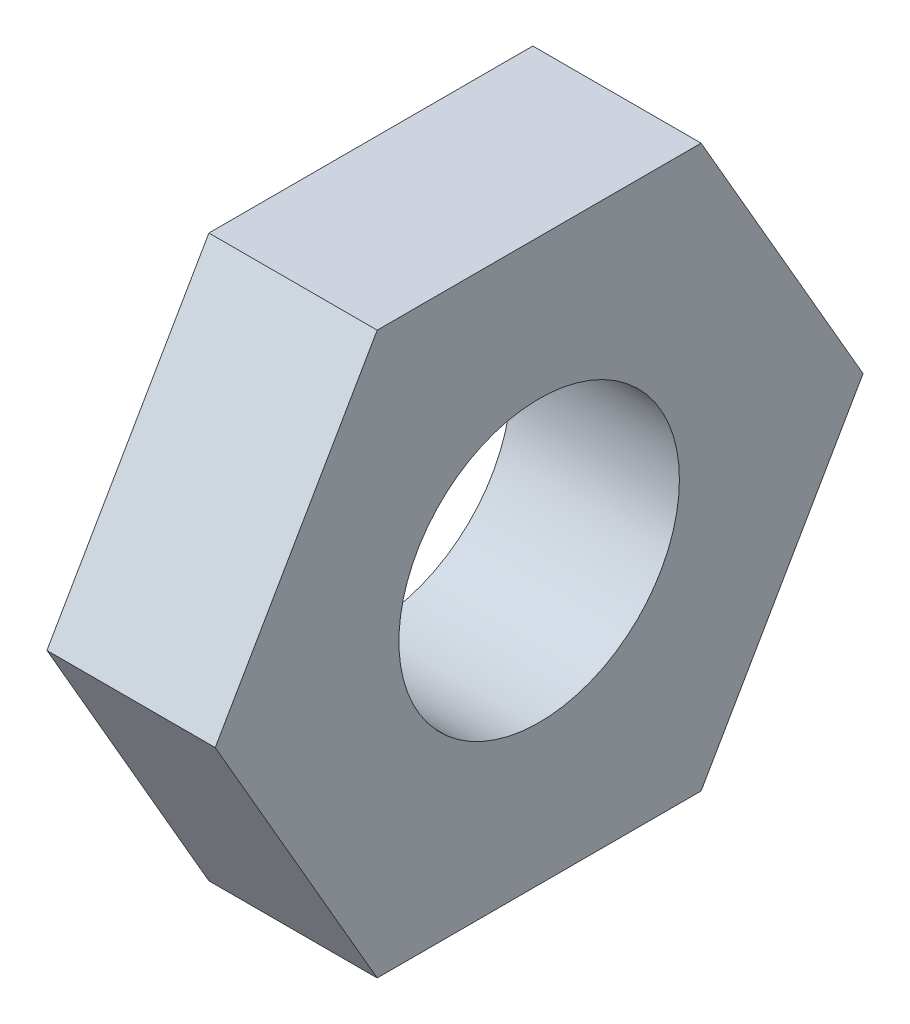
ISO-10303-21;
HEADER;
FILE_DESCRIPTION(('STEP AP214'),'2;1');
FILE_NAME('part.step','',(''),(''),'','','');
FILE_SCHEMA(('AUTOMOTIVE_DESIGN { 1 0 10303 214 1 1 1 1 }'));
ENDSEC;
DATA;
#1=APPLICATION_CONTEXT('core data for automotive mechanical design processes');
#2=APPLICATION_PROTOCOL_DEFINITION('international standard','automotive_design',2000,#1);
#3=PRODUCT_CONTEXT('',#1,'mechanical');
#4=PRODUCT('Part','Part','',(#3));
#5=PRODUCT_RELATED_PRODUCT_CATEGORY('part','',(#4));
#6=PRODUCT_DEFINITION_FORMATION('','',#4);
#7=PRODUCT_DEFINITION_CONTEXT('part definition',#1,'design');
#8=PRODUCT_DEFINITION('design','',#6,#7);
#9=PRODUCT_DEFINITION_SHAPE('','',#8);
#10=(LENGTH_UNIT() NAMED_UNIT(*) SI_UNIT(.MILLI.,.METRE.));
#11=(NAMED_UNIT(*) PLANE_ANGLE_UNIT() SI_UNIT($,.RADIAN.));
#12=(NAMED_UNIT(*) SI_UNIT($,.STERADIAN.) SOLID_ANGLE_UNIT());
#13=UNCERTAINTY_MEASURE_WITH_UNIT(LENGTH_MEASURE(1.E-05),#10,'distance_accuracy_value','');
#14=(GEOMETRIC_REPRESENTATION_CONTEXT(3) GLOBAL_UNCERTAINTY_ASSIGNED_CONTEXT((#13)) GLOBAL_UNIT_ASSIGNED_CONTEXT((#10,
#11,#12)) REPRESENTATION_CONTEXT('',''));
#15=CARTESIAN_POINT('',(0.,0.,0.));
#16=DIRECTION('',(0.,0.,1.));
#17=DIRECTION('',(1.,0.,0.));
#18=AXIS2_PLACEMENT_3D('',#15,#16,#17);
#19=CARTESIAN_POINT('',(3.,0.,0.));
#20=DIRECTION('',(1.,0.,0.));
#21=DIRECTION('',(0.,0.,-1.));
#22=AXIS2_PLACEMENT_3D('',#19,#20,#21);
#23=PLANE('',#22);
#24=DIRECTION('',(0.,0.866025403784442,-0.499999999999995));
#25=VECTOR('',#24,1.);
#26=CARTESIAN_POINT('',(3.,-4.99999999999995,-2.88675134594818));
#27=LINE('',#26,#25);
#28=CARTESIAN_POINT('',(3.,-4.99999999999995,-2.88675134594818));
#29=VERTEX_POINT('',#28);
#30=CARTESIAN_POINT('',(3.,0.,-5.77350269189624));
#31=VERTEX_POINT('',#30);
#32=EDGE_CURVE('E128',#29,#31,#27,.T.);
#33=ORIENTED_EDGE('',*,*,#32,.T.);
#34=DIRECTION('',(0.,0.866025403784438,0.500000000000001));
#35=VECTOR('',#34,1.);
#36=CARTESIAN_POINT('',(3.,0.,-5.77350269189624));
#37=LINE('',#36,#35);
#38=CARTESIAN_POINT('',(3.,4.99999999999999,-2.88675134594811));
#39=VERTEX_POINT('',#38);
#40=EDGE_CURVE('E86',#31,#39,#37,.T.);
#41=ORIENTED_EDGE('',*,*,#40,.T.);
#42=DIRECTION('',(0.,0.,1.));
#43=VECTOR('',#42,1.);
#44=CARTESIAN_POINT('',(3.,4.99999999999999,-2.88675134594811));
#45=LINE('',#44,#43);
#46=CARTESIAN_POINT('',(3.,4.99999999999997,2.88675134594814));
#47=VERTEX_POINT('',#46);
#48=EDGE_CURVE('E99',#39,#47,#45,.T.);
#49=ORIENTED_EDGE('',*,*,#48,.T.);
#50=DIRECTION('',(0.,-0.866025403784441,0.499999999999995));
#51=VECTOR('',#50,1.);
#52=CARTESIAN_POINT('',(3.,4.99999999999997,2.88675134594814));
#53=LINE('',#52,#51);
#54=CARTESIAN_POINT('',(3.,0.,5.77350269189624));
#55=VERTEX_POINT('',#54);
#56=EDGE_CURVE('E93',#47,#55,#53,.T.);
#57=ORIENTED_EDGE('',*,*,#56,.T.);
#58=DIRECTION('',(0.,-0.866025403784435,-0.500000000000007));
#59=VECTOR('',#58,1.);
#60=CARTESIAN_POINT('',(3.,0.,5.77350269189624));
#61=LINE('',#60,#59);
#62=CARTESIAN_POINT('',(3.,-5.00000000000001,2.88675134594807));
#63=VERTEX_POINT('',#62);
#64=EDGE_CURVE('E97',#55,#63,#61,.T.);
#65=ORIENTED_EDGE('',*,*,#64,.T.);
#66=DIRECTION('',(0.,0.,-1.));
#67=VECTOR('',#66,1.);
#68=CARTESIAN_POINT('',(3.,-5.00000000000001,2.88675134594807));
#69=LINE('',#68,#67);
#70=EDGE_CURVE('E49',#63,#29,#69,.T.);
#71=ORIENTED_EDGE('',*,*,#70,.T.);
#72=EDGE_LOOP('',(#33,#41,#49,#57,#65,#71));
#73=FACE_BOUND('',#72,.T.);
#74=CARTESIAN_POINT('',(3.,0.,0.));
#75=DIRECTION('',(1.,0.,0.));
#76=DIRECTION('',(0.,0.,-1.));
#77=AXIS2_PLACEMENT_3D('',#74,#75,#76);
#78=CIRCLE('',#77,2.5);
#79=CARTESIAN_POINT('',(3.,0.,-2.5));
#80=VERTEX_POINT('',#79);
#81=EDGE_CURVE('E121',#80,#80,#78,.T.);
#82=ORIENTED_EDGE('',*,*,#81,.F.);
#83=EDGE_LOOP('',(#82));
#84=FACE_BOUND('',#83,.T.);
#85=ADVANCED_FACE('F32',(#73,#84),#23,.T.);
#86=CARTESIAN_POINT('',(0.,0.,0.));
#87=DIRECTION('',(1.,0.,0.));
#88=DIRECTION('',(0.,0.,-1.));
#89=AXIS2_PLACEMENT_3D('',#86,#87,#88);
#90=PLANE('',#89);
#91=DIRECTION('',(0.,0.866025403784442,-0.499999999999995));
#92=VECTOR('',#91,1.);
#93=CARTESIAN_POINT('',(0.,-4.99999999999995,-2.88675134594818));
#94=LINE('',#93,#92);
#95=CARTESIAN_POINT('',(0.,-4.99999999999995,-2.88675134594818));
#96=VERTEX_POINT('',#95);
#97=CARTESIAN_POINT('',(0.,0.,-5.77350269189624));
#98=VERTEX_POINT('',#97);
#99=EDGE_CURVE('E117',#96,#98,#94,.T.);
#100=ORIENTED_EDGE('',*,*,#99,.F.);
#101=DIRECTION('',(0.,0.,-1.));
#102=VECTOR('',#101,1.);
#103=CARTESIAN_POINT('',(0.,-5.00000000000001,2.88675134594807));
#104=LINE('',#103,#102);
#105=CARTESIAN_POINT('',(0.,-5.00000000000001,2.88675134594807));
#106=VERTEX_POINT('',#105);
#107=EDGE_CURVE('E78',#106,#96,#104,.T.);
#108=ORIENTED_EDGE('',*,*,#107,.F.);
#109=DIRECTION('',(0.,-0.866025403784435,-0.500000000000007));
#110=VECTOR('',#109,1.);
#111=CARTESIAN_POINT('',(0.,0.,5.77350269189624));
#112=LINE('',#111,#110);
#113=CARTESIAN_POINT('',(0.,0.,5.77350269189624));
#114=VERTEX_POINT('',#113);
#115=EDGE_CURVE('E72',#114,#106,#112,.T.);
#116=ORIENTED_EDGE('',*,*,#115,.F.);
#117=DIRECTION('',(0.,-0.866025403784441,0.499999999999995));
#118=VECTOR('',#117,1.);
#119=CARTESIAN_POINT('',(0.,4.99999999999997,2.88675134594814));
#120=LINE('',#119,#118);
#121=CARTESIAN_POINT('',(0.,4.99999999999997,2.88675134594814));
#122=VERTEX_POINT('',#121);
#123=EDGE_CURVE('E107',#122,#114,#120,.T.);
#124=ORIENTED_EDGE('',*,*,#123,.F.);
#125=DIRECTION('',(0.,0.,1.));
#126=VECTOR('',#125,1.);
#127=CARTESIAN_POINT('',(0.,4.99999999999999,-2.88675134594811));
#128=LINE('',#127,#126);
#129=CARTESIAN_POINT('',(0.,4.99999999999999,-2.88675134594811));
#130=VERTEX_POINT('',#129);
#131=EDGE_CURVE('E123',#130,#122,#128,.T.);
#132=ORIENTED_EDGE('',*,*,#131,.F.);
#133=DIRECTION('',(0.,0.866025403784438,0.500000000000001));
#134=VECTOR('',#133,1.);
#135=CARTESIAN_POINT('',(0.,0.,-5.77350269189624));
#136=LINE('',#135,#134);
#137=EDGE_CURVE('E120',#98,#130,#136,.T.);
#138=ORIENTED_EDGE('',*,*,#137,.F.);
#139=EDGE_LOOP('',(#100,#108,#116,#124,#132,#138));
#140=FACE_BOUND('',#139,.T.);
#141=CARTESIAN_POINT('',(0.,0.,0.));
#142=DIRECTION('',(1.,0.,0.));
#143=DIRECTION('',(0.,0.,-1.));
#144=AXIS2_PLACEMENT_3D('',#141,#142,#143);
#145=CIRCLE('',#144,2.5);
#146=CARTESIAN_POINT('',(0.,0.,-2.5));
#147=VERTEX_POINT('',#146);
#148=EDGE_CURVE('E221',#147,#147,#145,.T.);
#149=ORIENTED_EDGE('',*,*,#148,.T.);
#150=EDGE_LOOP('',(#149));
#151=FACE_BOUND('',#150,.T.);
#152=ADVANCED_FACE('F137',(#140,#151),#90,.F.);
#153=CARTESIAN_POINT('',(3.,-4.99999999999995,-2.88675134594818));
#154=DIRECTION('',(0.,0.499999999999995,0.866025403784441));
#155=DIRECTION('',(0.,-0.866025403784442,0.499999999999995));
#156=AXIS2_PLACEMENT_3D('',#153,#154,#155);
#157=PLANE('',#156);
#158=ORIENTED_EDGE('',*,*,#99,.T.);
#159=DIRECTION('',(-1.,0.,0.));
#160=VECTOR('',#159,1.);
#161=CARTESIAN_POINT('',(3.,0.,-5.77350269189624));
#162=LINE('',#161,#160);
#163=EDGE_CURVE('E11',#31,#98,#162,.T.);
#164=ORIENTED_EDGE('',*,*,#163,.F.);
#165=ORIENTED_EDGE('',*,*,#32,.F.);
#166=DIRECTION('',(-1.,0.,0.));
#167=VECTOR('',#166,1.);
#168=CARTESIAN_POINT('',(3.,-4.99999999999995,-2.88675134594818));
#169=LINE('',#168,#167);
#170=EDGE_CURVE('E113',#29,#96,#169,.T.);
#171=ORIENTED_EDGE('',*,*,#170,.T.);
#172=EDGE_LOOP('',(#158,#164,#165,#171));
#173=FACE_BOUND('',#172,.T.);
#174=ADVANCED_FACE('F34',(#173),#157,.F.);
#175=CARTESIAN_POINT('',(3.,0.,-5.77350269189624));
#176=DIRECTION('',(0.,-0.500000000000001,0.866025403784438));
#177=DIRECTION('',(0.,-0.866025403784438,-0.500000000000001));
#178=AXIS2_PLACEMENT_3D('',#175,#176,#177);
#179=PLANE('',#178);
#180=ORIENTED_EDGE('',*,*,#137,.T.);
#181=DIRECTION('',(-1.,0.,0.));
#182=VECTOR('',#181,1.);
#183=CARTESIAN_POINT('',(3.,4.99999999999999,-2.88675134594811));
#184=LINE('',#183,#182);
#185=EDGE_CURVE('E41',#39,#130,#184,.T.);
#186=ORIENTED_EDGE('',*,*,#185,.F.);
#187=ORIENTED_EDGE('',*,*,#40,.F.);
#188=ORIENTED_EDGE('',*,*,#163,.T.);
#189=EDGE_LOOP('',(#180,#186,#187,#188));
#190=FACE_BOUND('',#189,.T.);
#191=ADVANCED_FACE('F162',(#190),#179,.F.);
#192=CARTESIAN_POINT('',(3.,4.99999999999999,-2.88675134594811));
#193=DIRECTION('',(0.,-1.,0.));
#194=DIRECTION('',(0.,0.,-1.));
#195=AXIS2_PLACEMENT_3D('',#192,#193,#194);
#196=PLANE('',#195);
#197=ORIENTED_EDGE('',*,*,#131,.T.);
#198=DIRECTION('',(-1.,0.,0.));
#199=VECTOR('',#198,1.);
#200=CARTESIAN_POINT('',(3.,4.99999999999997,2.88675134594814));
#201=LINE('',#200,#199);
#202=EDGE_CURVE('E108',#47,#122,#201,.T.);
#203=ORIENTED_EDGE('',*,*,#202,.F.);
#204=ORIENTED_EDGE('',*,*,#48,.F.);
#205=ORIENTED_EDGE('',*,*,#185,.T.);
#206=EDGE_LOOP('',(#197,#203,#204,#205));
#207=FACE_BOUND('',#206,.T.);
#208=ADVANCED_FACE('F134',(#207),#196,.F.);
#209=CARTESIAN_POINT('',(3.,4.99999999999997,2.88675134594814));
#210=DIRECTION('',(0.,-0.499999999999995,-0.866025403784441));
#211=DIRECTION('',(0.,0.866025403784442,-0.499999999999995));
#212=AXIS2_PLACEMENT_3D('',#209,#210,#211);
#213=PLANE('',#212);
#214=ORIENTED_EDGE('',*,*,#123,.T.);
#215=DIRECTION('',(-1.,0.,0.));
#216=VECTOR('',#215,1.);
#217=CARTESIAN_POINT('',(3.,0.,5.77350269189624));
#218=LINE('',#217,#216);
#219=EDGE_CURVE('E104',#55,#114,#218,.T.);
#220=ORIENTED_EDGE('',*,*,#219,.F.);
#221=ORIENTED_EDGE('',*,*,#56,.F.);
#222=ORIENTED_EDGE('',*,*,#202,.T.);
#223=EDGE_LOOP('',(#214,#220,#221,#222));
#224=FACE_BOUND('',#223,.T.);
#225=ADVANCED_FACE('F105',(#224),#213,.F.);
#226=CARTESIAN_POINT('',(3.,0.,5.77350269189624));
#227=DIRECTION('',(0.,0.500000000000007,-0.866025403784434));
#228=DIRECTION('',(0.,0.866025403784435,0.500000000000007));
#229=AXIS2_PLACEMENT_3D('',#226,#227,#228);
#230=PLANE('',#229);
#231=ORIENTED_EDGE('',*,*,#115,.T.);
#232=DIRECTION('',(-1.,0.,0.));
#233=VECTOR('',#232,1.);
#234=CARTESIAN_POINT('',(3.,-5.00000000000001,2.88675134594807));
#235=LINE('',#234,#233);
#236=EDGE_CURVE('E109',#63,#106,#235,.T.);
#237=ORIENTED_EDGE('',*,*,#236,.F.);
#238=ORIENTED_EDGE('',*,*,#64,.F.);
#239=ORIENTED_EDGE('',*,*,#219,.T.);
#240=EDGE_LOOP('',(#231,#237,#238,#239));
#241=FACE_BOUND('',#240,.T.);
#242=ADVANCED_FACE('F111',(#241),#230,.F.);
#243=CARTESIAN_POINT('',(3.,-5.00000000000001,2.88675134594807));
#244=DIRECTION('',(0.,1.,0.));
#245=DIRECTION('',(0.,0.,1.));
#246=AXIS2_PLACEMENT_3D('',#243,#244,#245);
#247=PLANE('',#246);
#248=ORIENTED_EDGE('',*,*,#107,.T.);
#249=ORIENTED_EDGE('',*,*,#170,.F.);
#250=ORIENTED_EDGE('',*,*,#70,.F.);
#251=ORIENTED_EDGE('',*,*,#236,.T.);
#252=EDGE_LOOP('',(#248,#249,#250,#251));
#253=FACE_BOUND('',#252,.T.);
#254=ADVANCED_FACE('F142',(#253),#247,.F.);
#255=CARTESIAN_POINT('',(3.,0.,0.));
#256=DIRECTION('',(-1.,0.,0.));
#257=DIRECTION('',(0.,0.,1.));
#258=AXIS2_PLACEMENT_3D('',#255,#256,#257);
#259=CYLINDRICAL_SURFACE('',#258,2.5);
#260=ORIENTED_EDGE('',*,*,#81,.T.);
#261=EDGE_LOOP('',(#260));
#262=FACE_BOUND('',#261,.T.);
#263=ORIENTED_EDGE('',*,*,#148,.F.);
#264=EDGE_LOOP('',(#263));
#265=FACE_BOUND('',#264,.T.);
#266=ADVANCED_FACE('F144',(#262,#265),#259,.F.);
#267=CLOSED_SHELL('',(#85,#152,#174,#191,#208,#225,#242,#254,#266));
#268=MANIFOLD_SOLID_BREP('B2',#267);
#269=ADVANCED_BREP_SHAPE_REPRESENTATION('',(#18,#268),#14);
#270=SHAPE_DEFINITION_REPRESENTATION(#9,#269);
ENDSEC;
END-ISO-10303-21;
